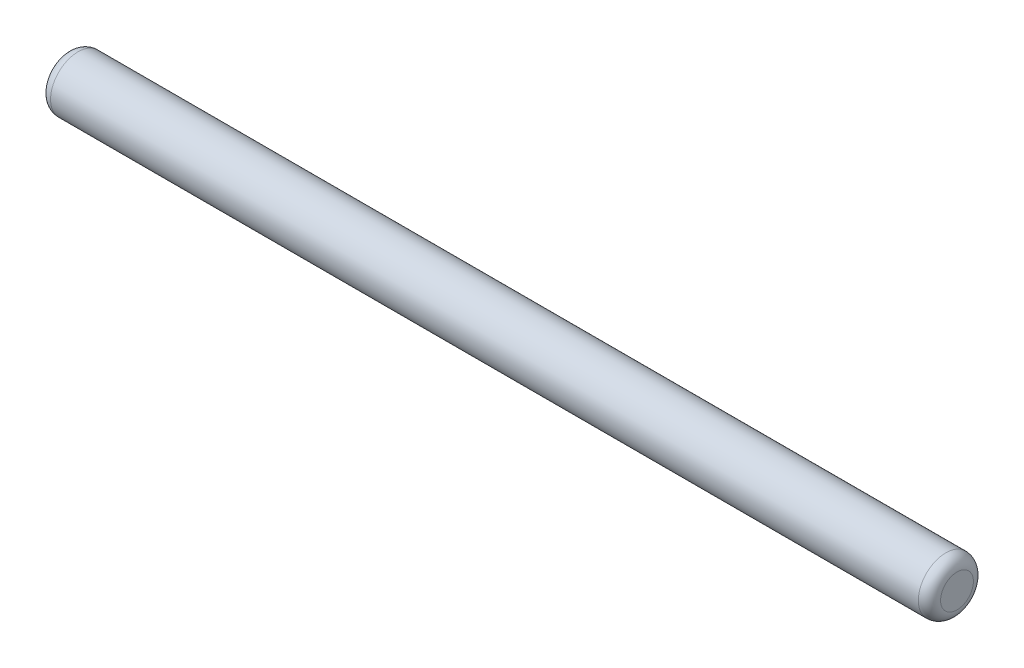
from build123d import *

# Parameters (mm, degrees)
SKETCH1_R           = 6.2865
BOSS_EXTRUDE1_DEPTH = 101.6
FILLET1_R           = 2.54


with BuildPart() as part:
    # Sketch1 → Boss-Extrude1 (new, symmetric)
    with BuildSketch(Plane(origin=(0, 0, 0), x_dir=(0, 0, -1), z_dir=(1, 0, 0))):
        Circle(SKETCH1_R)
    extrude(amount=BOSS_EXTRUDE1_DEPTH, both=True)

    # Fillet1
    fillet1_edges = [part.edges().sort_by_distance(p)[0] for p in [
        (-101.6, 0, 6.2865),
        (101.6, 0, 6.2865),
    ]]
    fillet(fillet1_edges, radius=FILLET1_R)


solid = part.part
